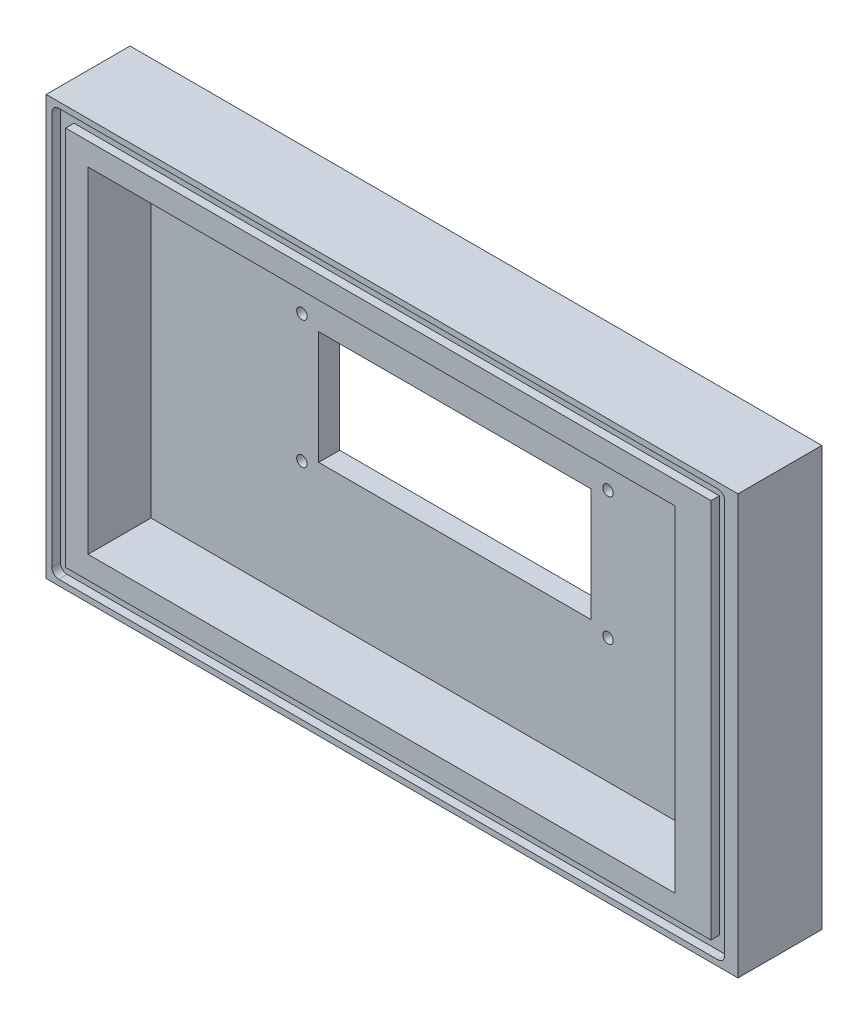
ISO-10303-21;
HEADER;
FILE_DESCRIPTION(('STEP AP214'),'2;1');
FILE_NAME('part.step','',(''),(''),'','','');
FILE_SCHEMA(('AUTOMOTIVE_DESIGN { 1 0 10303 214 1 1 1 1 }'));
ENDSEC;
DATA;
#1=APPLICATION_CONTEXT('core data for automotive mechanical design processes');
#2=APPLICATION_PROTOCOL_DEFINITION('international standard','automotive_design',2000,#1);
#3=PRODUCT_CONTEXT('',#1,'mechanical');
#4=PRODUCT('Part','Part','',(#3));
#5=PRODUCT_RELATED_PRODUCT_CATEGORY('part','',(#4));
#6=PRODUCT_DEFINITION_FORMATION('','',#4);
#7=PRODUCT_DEFINITION_CONTEXT('part definition',#1,'design');
#8=PRODUCT_DEFINITION('design','',#6,#7);
#9=PRODUCT_DEFINITION_SHAPE('','',#8);
#10=(LENGTH_UNIT() NAMED_UNIT(*) SI_UNIT(.MILLI.,.METRE.));
#11=(NAMED_UNIT(*) PLANE_ANGLE_UNIT() SI_UNIT($,.RADIAN.));
#12=(NAMED_UNIT(*) SI_UNIT($,.STERADIAN.) SOLID_ANGLE_UNIT());
#13=UNCERTAINTY_MEASURE_WITH_UNIT(LENGTH_MEASURE(1.E-05),#10,'distance_accuracy_value','');
#14=(GEOMETRIC_REPRESENTATION_CONTEXT(3) GLOBAL_UNCERTAINTY_ASSIGNED_CONTEXT((#13)) GLOBAL_UNIT_ASSIGNED_CONTEXT((#10,
#11,#12)) REPRESENTATION_CONTEXT('',''));
#15=CARTESIAN_POINT('',(0.,0.,0.));
#16=DIRECTION('',(0.,0.,1.));
#17=DIRECTION('',(1.,0.,0.));
#18=AXIS2_PLACEMENT_3D('',#15,#16,#17);
#19=CARTESIAN_POINT('',(0.,0.,20.));
#20=DIRECTION('',(0.,0.,1.));
#21=DIRECTION('',(1.,0.,0.));
#22=AXIS2_PLACEMENT_3D('',#19,#20,#21);
#23=PLANE('',#22);
#24=DIRECTION('',(1.,0.,0.));
#25=VECTOR('',#24,1.);
#26=CARTESIAN_POINT('',(0.,47.5401922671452,20.));
#27=LINE('',#26,#25);
#28=CARTESIAN_POINT('',(-65.2246638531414,47.5401922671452,20.));
#29=VERTEX_POINT('',#28);
#30=CARTESIAN_POINT('',(88.6945547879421,47.5401922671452,20.));
#31=VERTEX_POINT('',#30);
#32=EDGE_CURVE('E59',#29,#31,#27,.T.);
#33=ORIENTED_EDGE('',*,*,#32,.F.);
#34=DIRECTION('',(0.000175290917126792,0.999999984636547,0.));
#35=VECTOR('',#34,1.);
#36=CARTESIAN_POINT('',(-65.2329952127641,0.0114347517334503,20.));
#37=LINE('',#36,#35);
#38=CARTESIAN_POINT('',(-65.2405702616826,-43.202719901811,20.));
#39=VERTEX_POINT('',#38);
#40=EDGE_CURVE('E278',#39,#29,#37,.T.);
#41=ORIENTED_EDGE('',*,*,#40,.F.);
#42=DIRECTION('',(-1.,0.,0.));
#43=VECTOR('',#42,1.);
#44=CARTESIAN_POINT('',(0.,-43.202719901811,20.));
#45=LINE('',#44,#43);
#46=CARTESIAN_POINT('',(88.6945547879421,-43.202719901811,20.));
#47=VERTEX_POINT('',#46);
#48=EDGE_CURVE('E274',#47,#39,#45,.T.);
#49=ORIENTED_EDGE('',*,*,#48,.F.);
#50=DIRECTION('',(0.,-1.,0.));
#51=VECTOR('',#50,1.);
#52=CARTESIAN_POINT('',(88.6945547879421,0.,20.));
#53=LINE('',#52,#51);
#54=EDGE_CURVE('E271',#31,#47,#53,.T.);
#55=ORIENTED_EDGE('',*,*,#54,.F.);
#56=EDGE_LOOP('',(#33,#41,#49,#55));
#57=FACE_BOUND('',#56,.T.);
#58=DIRECTION('',(1.,0.,0.));
#59=VECTOR('',#58,1.);
#60=CARTESIAN_POINT('',(-59.8708560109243,-37.8327199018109,20.));
#61=LINE('',#60,#59);
#62=CARTESIAN_POINT('',(-59.8708560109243,-37.8327199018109,20.));
#63=VERTEX_POINT('',#62);
#64=CARTESIAN_POINT('',(80.1291439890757,-37.8327199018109,20.));
#65=VERTEX_POINT('',#64);
#66=EDGE_CURVE('E399',#63,#65,#61,.T.);
#67=ORIENTED_EDGE('',*,*,#66,.F.);
#68=DIRECTION('',(0.,-1.,0.));
#69=VECTOR('',#68,1.);
#70=CARTESIAN_POINT('',(-59.8708560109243,42.1672800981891,20.));
#71=LINE('',#70,#69);
#72=CARTESIAN_POINT('',(-59.8708560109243,42.1672800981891,20.));
#73=VERTEX_POINT('',#72);
#74=EDGE_CURVE('E405',#73,#63,#71,.T.);
#75=ORIENTED_EDGE('',*,*,#74,.F.);
#76=DIRECTION('',(1.,0.,0.));
#77=VECTOR('',#76,1.);
#78=CARTESIAN_POINT('',(-59.8708560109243,42.1672800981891,20.));
#79=LINE('',#78,#77);
#80=CARTESIAN_POINT('',(80.1291439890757,42.1672800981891,20.));
#81=VERTEX_POINT('',#80);
#82=EDGE_CURVE('E422',#73,#81,#79,.T.);
#83=ORIENTED_EDGE('',*,*,#82,.T.);
#84=DIRECTION('',(0.,-1.,0.));
#85=VECTOR('',#84,1.);
#86=CARTESIAN_POINT('',(80.1291439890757,42.1672800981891,20.));
#87=LINE('',#86,#85);
#88=EDGE_CURVE('E418',#81,#65,#87,.T.);
#89=ORIENTED_EDGE('',*,*,#88,.T.);
#90=EDGE_LOOP('',(#67,#75,#83,#89));
#91=FACE_BOUND('',#90,.T.);
#92=ADVANCED_FACE('F43',(#57,#91),#23,.T.);
#93=CARTESIAN_POINT('',(0.,0.,5.00000000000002));
#94=DIRECTION('',(0.,0.,-1.));
#95=DIRECTION('',(-1.,0.,0.));
#96=AXIS2_PLACEMENT_3D('',#93,#94,#95);
#97=PLANE('',#96);
#98=DIRECTION('',(1.,0.,0.));
#99=VECTOR('',#98,1.);
#100=CARTESIAN_POINT('',(-59.8708560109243,-37.8327199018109,5.00000000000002));
#101=LINE('',#100,#99);
#102=CARTESIAN_POINT('',(-59.8708560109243,-37.8327199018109,5.00000000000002));
#103=VERTEX_POINT('',#102);
#104=CARTESIAN_POINT('',(80.1291439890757,-37.8327199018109,5.00000000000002));
#105=VERTEX_POINT('',#104);
#106=EDGE_CURVE('E400',#103,#105,#101,.T.);
#107=ORIENTED_EDGE('',*,*,#106,.T.);
#108=DIRECTION('',(0.,-1.,0.));
#109=VECTOR('',#108,1.);
#110=CARTESIAN_POINT('',(80.1291439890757,42.1672800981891,5.00000000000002));
#111=LINE('',#110,#109);
#112=CARTESIAN_POINT('',(80.1291439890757,42.1672800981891,5.00000000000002));
#113=VERTEX_POINT('',#112);
#114=EDGE_CURVE('E404',#113,#105,#111,.T.);
#115=ORIENTED_EDGE('',*,*,#114,.F.);
#116=DIRECTION('',(1.,0.,0.));
#117=VECTOR('',#116,1.);
#118=CARTESIAN_POINT('',(-59.8708560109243,42.1672800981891,5.00000000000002));
#119=LINE('',#118,#117);
#120=CARTESIAN_POINT('',(-59.8708560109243,42.1672800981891,5.00000000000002));
#121=VERTEX_POINT('',#120);
#122=EDGE_CURVE('E408',#121,#113,#119,.T.);
#123=ORIENTED_EDGE('',*,*,#122,.F.);
#124=DIRECTION('',(0.,-1.,0.));
#125=VECTOR('',#124,1.);
#126=CARTESIAN_POINT('',(-59.8708560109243,42.1672800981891,5.00000000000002));
#127=LINE('',#126,#125);
#128=EDGE_CURVE('E411',#121,#103,#127,.T.);
#129=ORIENTED_EDGE('',*,*,#128,.T.);
#130=EDGE_LOOP('',(#107,#115,#123,#129));
#131=FACE_BOUND('',#130,.T.);
#132=CARTESIAN_POINT('',(-23.8708560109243,22.3923615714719,5.00000000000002));
#133=DIRECTION('',(0.,0.,1.));
#134=DIRECTION('',(1.,0.,0.));
#135=AXIS2_PLACEMENT_3D('',#132,#133,#134);
#136=CIRCLE('',#135,1.25);
#137=CARTESIAN_POINT('',(-22.6208560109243,22.3923615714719,5.00000000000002));
#138=VERTEX_POINT('',#137);
#139=EDGE_CURVE('E340',#138,#138,#136,.T.);
#140=ORIENTED_EDGE('',*,*,#139,.F.);
#141=EDGE_LOOP('',(#140));
#142=FACE_BOUND('',#141,.T.);
#143=CARTESIAN_POINT('',(-23.8708560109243,-8.05780137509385,5.00000000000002));
#144=DIRECTION('',(0.,0.,1.));
#145=DIRECTION('',(-1.,0.,0.));
#146=AXIS2_PLACEMENT_3D('',#143,#144,#145);
#147=CIRCLE('',#146,1.25);
#148=CARTESIAN_POINT('',(-25.1208560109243,-8.05780137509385,5.00000000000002));
#149=VERTEX_POINT('',#148);
#150=EDGE_CURVE('E345',#149,#149,#147,.T.);
#151=ORIENTED_EDGE('',*,*,#150,.F.);
#152=EDGE_LOOP('',(#151));
#153=FACE_BOUND('',#152,.T.);
#154=CARTESIAN_POINT('',(49.1291439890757,22.3923615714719,5.00000000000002));
#155=DIRECTION('',(0.,0.,1.));
#156=DIRECTION('',(-1.,0.,0.));
#157=AXIS2_PLACEMENT_3D('',#154,#155,#156);
#158=CIRCLE('',#157,1.25);
#159=CARTESIAN_POINT('',(47.8791439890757,22.3923615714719,5.00000000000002));
#160=VERTEX_POINT('',#159);
#161=EDGE_CURVE('E349',#160,#160,#158,.T.);
#162=ORIENTED_EDGE('',*,*,#161,.F.);
#163=EDGE_LOOP('',(#162));
#164=FACE_BOUND('',#163,.T.);
#165=CARTESIAN_POINT('',(49.1291439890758,-8.05780137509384,5.00000000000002));
#166=DIRECTION('',(0.,0.,1.));
#167=DIRECTION('',(1.,0.,0.));
#168=AXIS2_PLACEMENT_3D('',#165,#166,#167);
#169=CIRCLE('',#168,1.25);
#170=CARTESIAN_POINT('',(50.3791439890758,-8.05780137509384,5.00000000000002));
#171=VERTEX_POINT('',#170);
#172=EDGE_CURVE('E310',#171,#171,#169,.T.);
#173=ORIENTED_EDGE('',*,*,#172,.F.);
#174=EDGE_LOOP('',(#173));
#175=FACE_BOUND('',#174,.T.);
#176=DIRECTION('',(0.,-1.,0.));
#177=VECTOR('',#176,1.);
#178=CARTESIAN_POINT('',(-19.8708560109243,20.667280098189,5.00000000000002));
#179=LINE('',#178,#177);
#180=CARTESIAN_POINT('',(-19.8708560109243,20.667280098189,5.00000000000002));
#181=VERTEX_POINT('',#180);
#182=CARTESIAN_POINT('',(-19.8708560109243,-6.33271990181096,5.00000000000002));
#183=VERTEX_POINT('',#182);
#184=EDGE_CURVE('E344',#181,#183,#179,.T.);
#185=ORIENTED_EDGE('',*,*,#184,.F.);
#186=DIRECTION('',(-1.,0.,0.));
#187=VECTOR('',#186,1.);
#188=CARTESIAN_POINT('',(-19.8708560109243,20.667280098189,5.00000000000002));
#189=LINE('',#188,#187);
#190=CARTESIAN_POINT('',(45.1291439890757,20.667280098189,5.00000000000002));
#191=VERTEX_POINT('',#190);
#192=EDGE_CURVE('E366',#191,#181,#189,.T.);
#193=ORIENTED_EDGE('',*,*,#192,.F.);
#194=DIRECTION('',(0.,1.,0.));
#195=VECTOR('',#194,1.);
#196=CARTESIAN_POINT('',(45.1291439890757,20.667280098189,5.00000000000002));
#197=LINE('',#196,#195);
#198=CARTESIAN_POINT('',(45.1291439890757,-6.33271990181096,5.00000000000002));
#199=VERTEX_POINT('',#198);
#200=EDGE_CURVE('E363',#199,#191,#197,.T.);
#201=ORIENTED_EDGE('',*,*,#200,.F.);
#202=DIRECTION('',(1.,0.,0.));
#203=VECTOR('',#202,1.);
#204=CARTESIAN_POINT('',(-19.8708560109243,-6.33271990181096,5.00000000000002));
#205=LINE('',#204,#203);
#206=EDGE_CURVE('E359',#183,#199,#205,.T.);
#207=ORIENTED_EDGE('',*,*,#206,.F.);
#208=EDGE_LOOP('',(#185,#193,#201,#207));
#209=FACE_BOUND('',#208,.T.);
#210=ADVANCED_FACE('F507',(#131,#142,#153,#164,#175,#209),#97,.F.);
#211=CARTESIAN_POINT('',(-69.8708560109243,52.167280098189,20.));
#212=DIRECTION('',(1.,0.,0.));
#213=DIRECTION('',(0.,0.,-1.));
#214=AXIS2_PLACEMENT_3D('',#211,#212,#213);
#215=PLANE('',#214);
#216=DIRECTION('',(0.,-1.,0.));
#217=VECTOR('',#216,1.);
#218=CARTESIAN_POINT('',(-69.8708560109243,52.167280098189,0.));
#219=LINE('',#218,#217);
#220=CARTESIAN_POINT('',(-69.8708560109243,52.167280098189,0.));
#221=VERTEX_POINT('',#220);
#222=CARTESIAN_POINT('',(-69.8708560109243,-47.832719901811,0.));
#223=VERTEX_POINT('',#222);
#224=EDGE_CURVE('E432',#221,#223,#219,.T.);
#225=ORIENTED_EDGE('',*,*,#224,.T.);
#226=DIRECTION('',(0.,0.,-1.));
#227=VECTOR('',#226,1.);
#228=CARTESIAN_POINT('',(-69.8708560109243,-47.832719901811,20.));
#229=LINE('',#228,#227);
#230=CARTESIAN_POINT('',(-69.8708560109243,-47.832719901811,20.));
#231=VERTEX_POINT('',#230);
#232=EDGE_CURVE('E479',#231,#223,#229,.T.);
#233=ORIENTED_EDGE('',*,*,#232,.F.);
#234=DIRECTION('',(0.,-1.,0.));
#235=VECTOR('',#234,1.);
#236=CARTESIAN_POINT('',(-69.8708560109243,52.167280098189,20.));
#237=LINE('',#236,#235);
#238=CARTESIAN_POINT('',(-69.8708560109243,52.167280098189,20.));
#239=VERTEX_POINT('',#238);
#240=EDGE_CURVE('E442',#239,#231,#237,.T.);
#241=ORIENTED_EDGE('',*,*,#240,.F.);
#242=DIRECTION('',(0.,0.,-1.));
#243=VECTOR('',#242,1.);
#244=CARTESIAN_POINT('',(-69.8708560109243,52.167280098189,20.));
#245=LINE('',#244,#243);
#246=EDGE_CURVE('E456',#239,#221,#245,.T.);
#247=ORIENTED_EDGE('',*,*,#246,.T.);
#248=EDGE_LOOP('',(#225,#233,#241,#247));
#249=FACE_BOUND('',#248,.T.);
#250=ADVANCED_FACE('F45',(#249),#215,.F.);
#251=CARTESIAN_POINT('',(-69.8708560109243,-47.832719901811,20.));
#252=DIRECTION('',(0.,1.,0.));
#253=DIRECTION('',(-1.,0.,0.));
#254=AXIS2_PLACEMENT_3D('',#251,#252,#253);
#255=PLANE('',#254);
#256=DIRECTION('',(1.,0.,0.));
#257=VECTOR('',#256,1.);
#258=CARTESIAN_POINT('',(-69.8708560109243,-47.832719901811,0.));
#259=LINE('',#258,#257);
#260=CARTESIAN_POINT('',(95.1291439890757,-47.8327199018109,0.));
#261=VERTEX_POINT('',#260);
#262=EDGE_CURVE('E460',#223,#261,#259,.T.);
#263=ORIENTED_EDGE('',*,*,#262,.T.);
#264=DIRECTION('',(0.,0.,-1.));
#265=VECTOR('',#264,1.);
#266=CARTESIAN_POINT('',(95.1291439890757,-47.8327199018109,20.));
#267=LINE('',#266,#265);
#268=CARTESIAN_POINT('',(95.1291439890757,-47.8327199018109,20.));
#269=VERTEX_POINT('',#268);
#270=EDGE_CURVE('E475',#269,#261,#267,.T.);
#271=ORIENTED_EDGE('',*,*,#270,.F.);
#272=DIRECTION('',(1.,0.,0.));
#273=VECTOR('',#272,1.);
#274=CARTESIAN_POINT('',(-69.8708560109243,-47.832719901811,20.));
#275=LINE('',#274,#273);
#276=EDGE_CURVE('E446',#231,#269,#275,.T.);
#277=ORIENTED_EDGE('',*,*,#276,.F.);
#278=ORIENTED_EDGE('',*,*,#232,.T.);
#279=EDGE_LOOP('',(#263,#271,#277,#278));
#280=FACE_BOUND('',#279,.T.);
#281=ADVANCED_FACE('F557',(#280),#255,.F.);
#282=CARTESIAN_POINT('',(95.1291439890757,52.1672800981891,20.));
#283=DIRECTION('',(-1.,0.,0.));
#284=DIRECTION('',(0.,0.,1.));
#285=AXIS2_PLACEMENT_3D('',#282,#283,#284);
#286=PLANE('',#285);
#287=DIRECTION('',(0.,1.,0.));
#288=VECTOR('',#287,1.);
#289=CARTESIAN_POINT('',(95.1291439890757,52.1672800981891,0.));
#290=LINE('',#289,#288);
#291=CARTESIAN_POINT('',(95.1291439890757,52.1672800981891,0.));
#292=VERTEX_POINT('',#291);
#293=EDGE_CURVE('E463',#261,#292,#290,.T.);
#294=ORIENTED_EDGE('',*,*,#293,.T.);
#295=DIRECTION('',(0.,0.,-1.));
#296=VECTOR('',#295,1.);
#297=CARTESIAN_POINT('',(95.1291439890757,52.1672800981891,20.));
#298=LINE('',#297,#296);
#299=CARTESIAN_POINT('',(95.1291439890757,52.1672800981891,20.));
#300=VERTEX_POINT('',#299);
#301=EDGE_CURVE('E471',#300,#292,#298,.T.);
#302=ORIENTED_EDGE('',*,*,#301,.F.);
#303=DIRECTION('',(0.,1.,0.));
#304=VECTOR('',#303,1.);
#305=CARTESIAN_POINT('',(95.1291439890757,52.1672800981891,20.));
#306=LINE('',#305,#304);
#307=EDGE_CURVE('E450',#269,#300,#306,.T.);
#308=ORIENTED_EDGE('',*,*,#307,.F.);
#309=ORIENTED_EDGE('',*,*,#270,.T.);
#310=EDGE_LOOP('',(#294,#302,#308,#309));
#311=FACE_BOUND('',#310,.T.);
#312=ADVANCED_FACE('F545',(#311),#286,.F.);
#313=CARTESIAN_POINT('',(-69.8708560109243,52.167280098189,20.));
#314=DIRECTION('',(0.,-1.,0.));
#315=DIRECTION('',(1.,0.,0.));
#316=AXIS2_PLACEMENT_3D('',#313,#314,#315);
#317=PLANE('',#316);
#318=DIRECTION('',(-1.,0.,0.));
#319=VECTOR('',#318,1.);
#320=CARTESIAN_POINT('',(-69.8708560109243,52.167280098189,0.));
#321=LINE('',#320,#319);
#322=EDGE_CURVE('E447',#292,#221,#321,.T.);
#323=ORIENTED_EDGE('',*,*,#322,.T.);
#324=ORIENTED_EDGE('',*,*,#246,.F.);
#325=DIRECTION('',(-1.,0.,0.));
#326=VECTOR('',#325,1.);
#327=CARTESIAN_POINT('',(-69.8708560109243,52.167280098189,20.));
#328=LINE('',#327,#326);
#329=EDGE_CURVE('E453',#300,#239,#328,.T.);
#330=ORIENTED_EDGE('',*,*,#329,.F.);
#331=ORIENTED_EDGE('',*,*,#301,.T.);
#332=EDGE_LOOP('',(#323,#324,#330,#331));
#333=FACE_BOUND('',#332,.T.);
#334=ADVANCED_FACE('F537',(#333),#317,.F.);
#335=CARTESIAN_POINT('',(90.3245547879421,49.1672800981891,20.));
#336=DIRECTION('',(0.,0.,1.));
#337=DIRECTION('',(1.,0.,0.));
#338=AXIS2_PLACEMENT_3D('',#335,#336,#337);
#339=CIRCLE('',#338,1.63000000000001);
#340=CARTESIAN_POINT('',(91.9545547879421,49.1672800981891,20.));
#341=VERTEX_POINT('',#340);
#342=CARTESIAN_POINT('',(90.2271628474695,50.7943679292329,20.));
#343=VERTEX_POINT('',#342);
#344=EDGE_CURVE('E67',#341,#343,#339,.T.);
#345=ORIENTED_EDGE('',*,*,#344,.F.);
#346=DIRECTION('',(0.,-1.,0.));
#347=VECTOR('',#346,1.);
#348=CARTESIAN_POINT('',(91.9545547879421,0.,20.));
#349=LINE('',#348,#347);
#350=CARTESIAN_POINT('',(91.9545547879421,-44.832719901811,20.));
#351=VERTEX_POINT('',#350);
#352=EDGE_CURVE('E231',#341,#351,#349,.T.);
#353=ORIENTED_EDGE('',*,*,#352,.T.);
#354=CARTESIAN_POINT('',(90.3245547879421,-44.832719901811,20.));
#355=DIRECTION('',(0.,0.,1.));
#356=DIRECTION('',(1.,0.,0.));
#357=AXIS2_PLACEMENT_3D('',#354,#355,#356);
#358=CIRCLE('',#357,1.63000000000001);
#359=CARTESIAN_POINT('',(90.3245547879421,-46.462719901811,20.));
#360=VERTEX_POINT('',#359);
#361=EDGE_CURVE('E235',#360,#351,#358,.T.);
#362=ORIENTED_EDGE('',*,*,#361,.F.);
#363=DIRECTION('',(-1.,0.,0.));
#364=VECTOR('',#363,1.);
#365=CARTESIAN_POINT('',(0.,-46.462719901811,20.));
#366=LINE('',#365,#364);
#367=CARTESIAN_POINT('',(-66.8708560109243,-46.462719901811,20.));
#368=VERTEX_POINT('',#367);
#369=EDGE_CURVE('E300',#360,#368,#366,.T.);
#370=ORIENTED_EDGE('',*,*,#369,.T.);
#371=CARTESIAN_POINT('',(-66.8708560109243,-44.832719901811,20.));
#372=DIRECTION('',(0.,0.,1.));
#373=DIRECTION('',(1.,0.,0.));
#374=AXIS2_PLACEMENT_3D('',#371,#372,#373);
#375=CIRCLE('',#374,1.62999999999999);
#376=CARTESIAN_POINT('',(-68.5008559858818,-44.8324341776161,20.));
#377=VERTEX_POINT('',#376);
#378=EDGE_CURVE('E296',#377,#368,#375,.T.);
#379=ORIENTED_EDGE('',*,*,#378,.F.);
#380=DIRECTION('',(0.000175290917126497,0.999999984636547,0.));
#381=VECTOR('',#380,1.);
#382=CARTESIAN_POINT('',(-68.4929951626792,0.0120062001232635,20.));
#383=LINE('',#382,#381);
#384=CARTESIAN_POINT('',(-68.4843786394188,49.167565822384,20.));
#385=VERTEX_POINT('',#384);
#386=EDGE_CURVE('E292',#377,#385,#383,.T.);
#387=ORIENTED_EDGE('',*,*,#386,.T.);
#388=CARTESIAN_POINT('',(-66.8543786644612,49.1672800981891,20.));
#389=DIRECTION('',(0.,0.,1.));
#390=DIRECTION('',(1.,0.,0.));
#391=AXIS2_PLACEMENT_3D('',#388,#389,#390);
#392=CIRCLE('',#391,1.62999999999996);
#393=CARTESIAN_POINT('',(-66.7569867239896,50.7943679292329,20.));
#394=VERTEX_POINT('',#393);
#395=EDGE_CURVE('E288',#394,#385,#392,.T.);
#396=ORIENTED_EDGE('',*,*,#395,.F.);
#397=DIRECTION('',(1.,0.,0.));
#398=VECTOR('',#397,1.);
#399=CARTESIAN_POINT('',(0.,50.7943679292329,20.));
#400=LINE('',#399,#398);
#401=EDGE_CURVE('E284',#394,#343,#400,.T.);
#402=ORIENTED_EDGE('',*,*,#401,.T.);
#403=EDGE_LOOP('',(#345,#353,#362,#370,#379,#387,#396,#402));
#404=FACE_BOUND('',#403,.T.);
#405=ORIENTED_EDGE('',*,*,#240,.T.);
#406=ORIENTED_EDGE('',*,*,#276,.T.);
#407=ORIENTED_EDGE('',*,*,#307,.T.);
#408=ORIENTED_EDGE('',*,*,#329,.T.);
#409=EDGE_LOOP('',(#405,#406,#407,#408));
#410=FACE_BOUND('',#409,.T.);
#411=ADVANCED_FACE('F527',(#404,#410),#23,.T.);
#412=CARTESIAN_POINT('',(0.,0.,0.));
#413=DIRECTION('',(0.,0.,1.));
#414=DIRECTION('',(1.,0.,0.));
#415=AXIS2_PLACEMENT_3D('',#412,#413,#414);
#416=PLANE('',#415);
#417=CARTESIAN_POINT('',(49.1291439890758,-8.05780137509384,0.));
#418=DIRECTION('',(0.,0.,1.));
#419=DIRECTION('',(1.,0.,0.));
#420=AXIS2_PLACEMENT_3D('',#417,#418,#419);
#421=CIRCLE('',#420,1.25);
#422=CARTESIAN_POINT('',(50.3791439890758,-8.05780137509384,0.));
#423=VERTEX_POINT('',#422);
#424=EDGE_CURVE('E395',#423,#423,#421,.T.);
#425=ORIENTED_EDGE('',*,*,#424,.T.);
#426=EDGE_LOOP('',(#425));
#427=FACE_BOUND('',#426,.T.);
#428=CARTESIAN_POINT('',(49.1291439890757,22.3923615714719,0.));
#429=DIRECTION('',(0.,0.,1.));
#430=DIRECTION('',(1.,0.,0.));
#431=AXIS2_PLACEMENT_3D('',#428,#429,#430);
#432=CIRCLE('',#431,1.25);
#433=CARTESIAN_POINT('',(50.3791439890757,22.3923615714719,0.));
#434=VERTEX_POINT('',#433);
#435=EDGE_CURVE('E391',#434,#434,#432,.T.);
#436=ORIENTED_EDGE('',*,*,#435,.T.);
#437=EDGE_LOOP('',(#436));
#438=FACE_BOUND('',#437,.T.);
#439=CARTESIAN_POINT('',(-23.8708560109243,-8.05780137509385,0.));
#440=DIRECTION('',(0.,0.,1.));
#441=DIRECTION('',(1.,0.,0.));
#442=AXIS2_PLACEMENT_3D('',#439,#440,#441);
#443=CIRCLE('',#442,1.25);
#444=CARTESIAN_POINT('',(-22.6208560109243,-8.05780137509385,0.));
#445=VERTEX_POINT('',#444);
#446=EDGE_CURVE('E387',#445,#445,#443,.T.);
#447=ORIENTED_EDGE('',*,*,#446,.T.);
#448=EDGE_LOOP('',(#447));
#449=FACE_BOUND('',#448,.T.);
#450=CARTESIAN_POINT('',(-23.8708560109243,22.3923615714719,0.));
#451=DIRECTION('',(0.,0.,1.));
#452=DIRECTION('',(1.,0.,0.));
#453=AXIS2_PLACEMENT_3D('',#450,#451,#452);
#454=CIRCLE('',#453,1.25);
#455=CARTESIAN_POINT('',(-22.6208560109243,22.3923615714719,0.));
#456=VERTEX_POINT('',#455);
#457=EDGE_CURVE('E374',#456,#456,#454,.T.);
#458=ORIENTED_EDGE('',*,*,#457,.T.);
#459=EDGE_LOOP('',(#458));
#460=FACE_BOUND('',#459,.T.);
#461=DIRECTION('',(-1.,0.,0.));
#462=VECTOR('',#461,1.);
#463=CARTESIAN_POINT('',(0.,20.667280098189,0.));
#464=LINE('',#463,#462);
#465=CARTESIAN_POINT('',(45.1291439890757,20.667280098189,0.));
#466=VERTEX_POINT('',#465);
#467=CARTESIAN_POINT('',(-19.8708560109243,20.667280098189,0.));
#468=VERTEX_POINT('',#467);
#469=EDGE_CURVE('E52',#466,#468,#464,.T.);
#470=ORIENTED_EDGE('',*,*,#469,.T.);
#471=DIRECTION('',(0.,-1.,0.));
#472=VECTOR('',#471,1.);
#473=CARTESIAN_POINT('',(-19.8708560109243,0.,0.));
#474=LINE('',#473,#472);
#475=CARTESIAN_POINT('',(-19.8708560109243,-6.33271990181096,0.));
#476=VERTEX_POINT('',#475);
#477=EDGE_CURVE('E11',#468,#476,#474,.T.);
#478=ORIENTED_EDGE('',*,*,#477,.T.);
#479=DIRECTION('',(1.,0.,0.));
#480=VECTOR('',#479,1.);
#481=CARTESIAN_POINT('',(0.,-6.33271990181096,0.));
#482=LINE('',#481,#480);
#483=CARTESIAN_POINT('',(45.1291439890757,-6.33271990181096,0.));
#484=VERTEX_POINT('',#483);
#485=EDGE_CURVE('E483',#476,#484,#482,.T.);
#486=ORIENTED_EDGE('',*,*,#485,.T.);
#487=DIRECTION('',(0.,1.,0.));
#488=VECTOR('',#487,1.);
#489=CARTESIAN_POINT('',(45.1291439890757,0.,0.));
#490=LINE('',#489,#488);
#491=EDGE_CURVE('E487',#484,#466,#490,.T.);
#492=ORIENTED_EDGE('',*,*,#491,.T.);
#493=EDGE_LOOP('',(#470,#478,#486,#492));
#494=FACE_BOUND('',#493,.T.);
#495=ORIENTED_EDGE('',*,*,#224,.F.);
#496=ORIENTED_EDGE('',*,*,#322,.F.);
#497=ORIENTED_EDGE('',*,*,#293,.F.);
#498=ORIENTED_EDGE('',*,*,#262,.F.);
#499=EDGE_LOOP('',(#495,#496,#497,#498));
#500=FACE_BOUND('',#499,.T.);
#501=ADVANCED_FACE('F493',(#427,#438,#449,#460,#494,#500),#416,.F.);
#502=CARTESIAN_POINT('',(-59.8708560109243,-37.8327199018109,5.00000000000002));
#503=DIRECTION('',(0.,-1.,0.));
#504=DIRECTION('',(0.,0.,-1.));
#505=AXIS2_PLACEMENT_3D('',#502,#503,#504);
#506=PLANE('',#505);
#507=ORIENTED_EDGE('',*,*,#66,.T.);
#508=DIRECTION('',(0.,0.,1.));
#509=VECTOR('',#508,1.);
#510=CARTESIAN_POINT('',(80.1291439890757,-37.8327199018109,5.00000000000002));
#511=LINE('',#510,#509);
#512=EDGE_CURVE('E415',#105,#65,#511,.T.);
#513=ORIENTED_EDGE('',*,*,#512,.F.);
#514=ORIENTED_EDGE('',*,*,#106,.F.);
#515=DIRECTION('',(0.,0.,1.));
#516=VECTOR('',#515,1.);
#517=CARTESIAN_POINT('',(-59.8708560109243,-37.8327199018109,5.00000000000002));
#518=LINE('',#517,#516);
#519=EDGE_CURVE('E429',#103,#63,#518,.T.);
#520=ORIENTED_EDGE('',*,*,#519,.T.);
#521=EDGE_LOOP('',(#507,#513,#514,#520));
#522=FACE_BOUND('',#521,.T.);
#523=ADVANCED_FACE('F543',(#522),#506,.F.);
#524=CARTESIAN_POINT('',(-59.8708560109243,42.1672800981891,5.00000000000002));
#525=DIRECTION('',(-1.,0.,0.));
#526=DIRECTION('',(0.,-1.,0.));
#527=AXIS2_PLACEMENT_3D('',#524,#525,#526);
#528=PLANE('',#527);
#529=ORIENTED_EDGE('',*,*,#74,.T.);
#530=ORIENTED_EDGE('',*,*,#519,.F.);
#531=ORIENTED_EDGE('',*,*,#128,.F.);
#532=DIRECTION('',(0.,0.,1.));
#533=VECTOR('',#532,1.);
#534=CARTESIAN_POINT('',(-59.8708560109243,42.1672800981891,5.00000000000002));
#535=LINE('',#534,#533);
#536=EDGE_CURVE('E433',#121,#73,#535,.T.);
#537=ORIENTED_EDGE('',*,*,#536,.T.);
#538=EDGE_LOOP('',(#529,#530,#531,#537));
#539=FACE_BOUND('',#538,.T.);
#540=ADVANCED_FACE('F895',(#539),#528,.F.);
#541=CARTESIAN_POINT('',(-59.8708560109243,42.1672800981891,5.00000000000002));
#542=DIRECTION('',(0.,-1.,0.));
#543=DIRECTION('',(0.,0.,-1.));
#544=AXIS2_PLACEMENT_3D('',#541,#542,#543);
#545=PLANE('',#544);
#546=ORIENTED_EDGE('',*,*,#82,.F.);
#547=ORIENTED_EDGE('',*,*,#536,.F.);
#548=ORIENTED_EDGE('',*,*,#122,.T.);
#549=DIRECTION('',(0.,0.,1.));
#550=VECTOR('',#549,1.);
#551=CARTESIAN_POINT('',(80.1291439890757,42.1672800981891,5.00000000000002));
#552=LINE('',#551,#550);
#553=EDGE_CURVE('E436',#113,#81,#552,.T.);
#554=ORIENTED_EDGE('',*,*,#553,.T.);
#555=EDGE_LOOP('',(#546,#547,#548,#554));
#556=FACE_BOUND('',#555,.T.);
#557=ADVANCED_FACE('F904',(#556),#545,.T.);
#558=CARTESIAN_POINT('',(80.1291439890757,42.1672800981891,5.00000000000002));
#559=DIRECTION('',(-1.,0.,0.));
#560=DIRECTION('',(0.,0.,1.));
#561=AXIS2_PLACEMENT_3D('',#558,#559,#560);
#562=PLANE('',#561);
#563=ORIENTED_EDGE('',*,*,#88,.F.);
#564=ORIENTED_EDGE('',*,*,#553,.F.);
#565=ORIENTED_EDGE('',*,*,#114,.T.);
#566=ORIENTED_EDGE('',*,*,#512,.T.);
#567=EDGE_LOOP('',(#563,#564,#565,#566));
#568=FACE_BOUND('',#567,.T.);
#569=ADVANCED_FACE('F585',(#568),#562,.T.);
#570=CARTESIAN_POINT('',(-23.8708560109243,22.3923615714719,-9.99999999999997));
#571=DIRECTION('',(0.,0.,1.));
#572=DIRECTION('',(1.,0.,0.));
#573=AXIS2_PLACEMENT_3D('',#570,#571,#572);
#574=CYLINDRICAL_SURFACE('',#573,1.25);
#575=ORIENTED_EDGE('',*,*,#139,.T.);
#576=EDGE_LOOP('',(#575));
#577=FACE_BOUND('',#576,.T.);
#578=ORIENTED_EDGE('',*,*,#457,.F.);
#579=EDGE_LOOP('',(#578));
#580=FACE_BOUND('',#579,.T.);
#581=ADVANCED_FACE('F600',(#577,#580),#574,.F.);
#582=CARTESIAN_POINT('',(-23.8708560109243,-8.05780137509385,-9.99999999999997));
#583=DIRECTION('',(0.,0.,1.));
#584=DIRECTION('',(1.,0.,0.));
#585=AXIS2_PLACEMENT_3D('',#582,#583,#584);
#586=CYLINDRICAL_SURFACE('',#585,1.25);
#587=ORIENTED_EDGE('',*,*,#150,.T.);
#588=EDGE_LOOP('',(#587));
#589=FACE_BOUND('',#588,.T.);
#590=ORIENTED_EDGE('',*,*,#446,.F.);
#591=EDGE_LOOP('',(#590));
#592=FACE_BOUND('',#591,.T.);
#593=ADVANCED_FACE('F605',(#589,#592),#586,.F.);
#594=CARTESIAN_POINT('',(49.1291439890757,22.3923615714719,-9.99999999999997));
#595=DIRECTION('',(0.,0.,1.));
#596=DIRECTION('',(1.,0.,0.));
#597=AXIS2_PLACEMENT_3D('',#594,#595,#596);
#598=CYLINDRICAL_SURFACE('',#597,1.25);
#599=ORIENTED_EDGE('',*,*,#161,.T.);
#600=EDGE_LOOP('',(#599));
#601=FACE_BOUND('',#600,.T.);
#602=ORIENTED_EDGE('',*,*,#435,.F.);
#603=EDGE_LOOP('',(#602));
#604=FACE_BOUND('',#603,.T.);
#605=ADVANCED_FACE('F615',(#601,#604),#598,.F.);
#606=CARTESIAN_POINT('',(49.1291439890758,-8.05780137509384,-9.99999999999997));
#607=DIRECTION('',(0.,0.,1.));
#608=DIRECTION('',(1.,0.,0.));
#609=AXIS2_PLACEMENT_3D('',#606,#607,#608);
#610=CYLINDRICAL_SURFACE('',#609,1.25);
#611=ORIENTED_EDGE('',*,*,#172,.T.);
#612=EDGE_LOOP('',(#611));
#613=FACE_BOUND('',#612,.T.);
#614=ORIENTED_EDGE('',*,*,#424,.F.);
#615=EDGE_LOOP('',(#614));
#616=FACE_BOUND('',#615,.T.);
#617=ADVANCED_FACE('F626',(#613,#616),#610,.F.);
#618=CARTESIAN_POINT('',(-19.8708560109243,20.667280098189,-9.99999999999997));
#619=DIRECTION('',(-1.,0.,0.));
#620=DIRECTION('',(0.,-1.,0.));
#621=AXIS2_PLACEMENT_3D('',#618,#619,#620);
#622=PLANE('',#621);
#623=DIRECTION('',(0.,0.,1.));
#624=VECTOR('',#623,1.);
#625=CARTESIAN_POINT('',(-19.8708560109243,20.667280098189,-9.99999999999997));
#626=LINE('',#625,#624);
#627=EDGE_CURVE('E371',#468,#181,#626,.T.);
#628=ORIENTED_EDGE('',*,*,#627,.T.);
#629=ORIENTED_EDGE('',*,*,#184,.T.);
#630=DIRECTION('',(0.,0.,1.));
#631=VECTOR('',#630,1.);
#632=CARTESIAN_POINT('',(-19.8708560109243,-6.33271990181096,-9.99999999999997));
#633=LINE('',#632,#631);
#634=EDGE_CURVE('E370',#476,#183,#633,.T.);
#635=ORIENTED_EDGE('',*,*,#634,.F.);
#636=ORIENTED_EDGE('',*,*,#477,.F.);
#637=EDGE_LOOP('',(#628,#629,#635,#636));
#638=FACE_BOUND('',#637,.T.);
#639=ADVANCED_FACE('F510',(#638),#622,.F.);
#640=CARTESIAN_POINT('',(-19.8708560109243,20.667280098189,-9.99999999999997));
#641=DIRECTION('',(0.,1.,0.));
#642=DIRECTION('',(0.,0.,1.));
#643=AXIS2_PLACEMENT_3D('',#640,#641,#642);
#644=PLANE('',#643);
#645=DIRECTION('',(0.,0.,1.));
#646=VECTOR('',#645,1.);
#647=CARTESIAN_POINT('',(45.1291439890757,20.667280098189,-9.99999999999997));
#648=LINE('',#647,#646);
#649=EDGE_CURVE('E375',#466,#191,#648,.T.);
#650=ORIENTED_EDGE('',*,*,#649,.T.);
#651=ORIENTED_EDGE('',*,*,#192,.T.);
#652=ORIENTED_EDGE('',*,*,#627,.F.);
#653=ORIENTED_EDGE('',*,*,#469,.F.);
#654=EDGE_LOOP('',(#650,#651,#652,#653));
#655=FACE_BOUND('',#654,.T.);
#656=ADVANCED_FACE('F499',(#655),#644,.F.);
#657=CARTESIAN_POINT('',(45.1291439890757,20.667280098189,-9.99999999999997));
#658=DIRECTION('',(1.,0.,0.));
#659=DIRECTION('',(0.,0.,-1.));
#660=AXIS2_PLACEMENT_3D('',#657,#658,#659);
#661=PLANE('',#660);
#662=DIRECTION('',(0.,0.,1.));
#663=VECTOR('',#662,1.);
#664=CARTESIAN_POINT('',(45.1291439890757,-6.33271990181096,-9.99999999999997));
#665=LINE('',#664,#663);
#666=EDGE_CURVE('E379',#484,#199,#665,.T.);
#667=ORIENTED_EDGE('',*,*,#666,.T.);
#668=ORIENTED_EDGE('',*,*,#200,.T.);
#669=ORIENTED_EDGE('',*,*,#649,.F.);
#670=ORIENTED_EDGE('',*,*,#491,.F.);
#671=EDGE_LOOP('',(#667,#668,#669,#670));
#672=FACE_BOUND('',#671,.T.);
#673=ADVANCED_FACE('F502',(#672),#661,.F.);
#674=CARTESIAN_POINT('',(-19.8708560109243,-6.33271990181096,-9.99999999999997));
#675=DIRECTION('',(0.,-1.,0.));
#676=DIRECTION('',(0.,0.,-1.));
#677=AXIS2_PLACEMENT_3D('',#674,#675,#676);
#678=PLANE('',#677);
#679=ORIENTED_EDGE('',*,*,#634,.T.);
#680=ORIENTED_EDGE('',*,*,#206,.T.);
#681=ORIENTED_EDGE('',*,*,#666,.F.);
#682=ORIENTED_EDGE('',*,*,#485,.F.);
#683=EDGE_LOOP('',(#679,#680,#681,#682));
#684=FACE_BOUND('',#683,.T.);
#685=ADVANCED_FACE('F512',(#684),#678,.F.);
#686=CARTESIAN_POINT('',(90.3245547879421,49.1672800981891,18.));
#687=DIRECTION('',(0.,0.,1.));
#688=DIRECTION('',(1.,0.,0.));
#689=AXIS2_PLACEMENT_3D('',#686,#687,#688);
#690=CYLINDRICAL_SURFACE('',#689,1.63000000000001);
#691=ORIENTED_EDGE('',*,*,#344,.T.);
#692=DIRECTION('',(0.,0.,1.));
#693=VECTOR('',#692,1.);
#694=CARTESIAN_POINT('',(90.2271628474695,50.7943679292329,18.));
#695=LINE('',#694,#693);
#696=CARTESIAN_POINT('',(90.2271628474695,50.7943679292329,18.));
#697=VERTEX_POINT('',#696);
#698=EDGE_CURVE('E329',#697,#343,#695,.T.);
#699=ORIENTED_EDGE('',*,*,#698,.F.);
#700=CARTESIAN_POINT('',(90.3245547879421,49.1672800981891,18.));
#701=DIRECTION('',(0.,0.,1.));
#702=DIRECTION('',(1.,0.,0.));
#703=AXIS2_PLACEMENT_3D('',#700,#701,#702);
#704=CIRCLE('',#703,1.63000000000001);
#705=CARTESIAN_POINT('',(91.9545547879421,49.1672800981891,18.));
#706=VERTEX_POINT('',#705);
#707=EDGE_CURVE('E242',#706,#697,#704,.T.);
#708=ORIENTED_EDGE('',*,*,#707,.F.);
#709=DIRECTION('',(0.,0.,1.));
#710=VECTOR('',#709,1.);
#711=CARTESIAN_POINT('',(91.9545547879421,49.1672800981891,18.));
#712=LINE('',#711,#710);
#713=EDGE_CURVE('E307',#706,#341,#712,.T.);
#714=ORIENTED_EDGE('',*,*,#713,.T.);
#715=EDGE_LOOP('',(#691,#699,#708,#714));
#716=FACE_BOUND('',#715,.T.);
#717=ADVANCED_FACE('F514',(#716),#690,.F.);
#718=CARTESIAN_POINT('',(91.9545547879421,0.,18.));
#719=DIRECTION('',(-1.,0.,0.));
#720=DIRECTION('',(0.,-1.,0.));
#721=AXIS2_PLACEMENT_3D('',#718,#719,#720);
#722=PLANE('',#721);
#723=ORIENTED_EDGE('',*,*,#352,.F.);
#724=ORIENTED_EDGE('',*,*,#713,.F.);
#725=DIRECTION('',(0.,-1.,0.));
#726=VECTOR('',#725,1.);
#727=CARTESIAN_POINT('',(91.9545547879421,0.,18.));
#728=LINE('',#727,#726);
#729=CARTESIAN_POINT('',(91.9545547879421,-44.832719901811,18.));
#730=VERTEX_POINT('',#729);
#731=EDGE_CURVE('E215',#706,#730,#728,.T.);
#732=ORIENTED_EDGE('',*,*,#731,.T.);
#733=DIRECTION('',(0.,0.,1.));
#734=VECTOR('',#733,1.);
#735=CARTESIAN_POINT('',(91.9545547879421,-44.832719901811,18.));
#736=LINE('',#735,#734);
#737=EDGE_CURVE('E311',#730,#351,#736,.T.);
#738=ORIENTED_EDGE('',*,*,#737,.T.);
#739=EDGE_LOOP('',(#723,#724,#732,#738));
#740=FACE_BOUND('',#739,.T.);
#741=ADVANCED_FACE('F520',(#740),#722,.T.);
#742=CARTESIAN_POINT('',(90.3245547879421,-44.832719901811,18.));
#743=DIRECTION('',(0.,0.,1.));
#744=DIRECTION('',(1.,0.,0.));
#745=AXIS2_PLACEMENT_3D('',#742,#743,#744);
#746=CYLINDRICAL_SURFACE('',#745,1.63000000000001);
#747=ORIENTED_EDGE('',*,*,#361,.T.);
#748=ORIENTED_EDGE('',*,*,#737,.F.);
#749=CARTESIAN_POINT('',(90.3245547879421,-44.832719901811,18.));
#750=DIRECTION('',(0.,0.,1.));
#751=DIRECTION('',(1.,0.,0.));
#752=AXIS2_PLACEMENT_3D('',#749,#750,#751);
#753=CIRCLE('',#752,1.63000000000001);
#754=CARTESIAN_POINT('',(90.3245547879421,-46.462719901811,18.));
#755=VERTEX_POINT('',#754);
#756=EDGE_CURVE('E263',#755,#730,#753,.T.);
#757=ORIENTED_EDGE('',*,*,#756,.F.);
#758=DIRECTION('',(0.,0.,1.));
#759=VECTOR('',#758,1.);
#760=CARTESIAN_POINT('',(90.3245547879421,-46.462719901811,18.));
#761=LINE('',#760,#759);
#762=EDGE_CURVE('E314',#755,#360,#761,.T.);
#763=ORIENTED_EDGE('',*,*,#762,.T.);
#764=EDGE_LOOP('',(#747,#748,#757,#763));
#765=FACE_BOUND('',#764,.T.);
#766=ADVANCED_FACE('F692',(#765),#746,.F.);
#767=CARTESIAN_POINT('',(0.,-46.462719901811,18.));
#768=DIRECTION('',(0.,1.,0.));
#769=DIRECTION('',(-1.,0.,0.));
#770=AXIS2_PLACEMENT_3D('',#767,#768,#769);
#771=PLANE('',#770);
#772=ORIENTED_EDGE('',*,*,#369,.F.);
#773=ORIENTED_EDGE('',*,*,#762,.F.);
#774=DIRECTION('',(-1.,0.,0.));
#775=VECTOR('',#774,1.);
#776=CARTESIAN_POINT('',(0.,-46.462719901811,18.));
#777=LINE('',#776,#775);
#778=CARTESIAN_POINT('',(-66.8708560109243,-46.462719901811,18.));
#779=VERTEX_POINT('',#778);
#780=EDGE_CURVE('E260',#755,#779,#777,.T.);
#781=ORIENTED_EDGE('',*,*,#780,.T.);
#782=DIRECTION('',(0.,0.,1.));
#783=VECTOR('',#782,1.);
#784=CARTESIAN_POINT('',(-66.8708560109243,-46.462719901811,18.));
#785=LINE('',#784,#783);
#786=EDGE_CURVE('E317',#779,#368,#785,.T.);
#787=ORIENTED_EDGE('',*,*,#786,.T.);
#788=EDGE_LOOP('',(#772,#773,#781,#787));
#789=FACE_BOUND('',#788,.T.);
#790=ADVANCED_FACE('F704',(#789),#771,.T.);
#791=CARTESIAN_POINT('',(-66.8708560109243,-44.832719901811,18.));
#792=DIRECTION('',(0.,0.,1.));
#793=DIRECTION('',(1.,0.,0.));
#794=AXIS2_PLACEMENT_3D('',#791,#792,#793);
#795=CYLINDRICAL_SURFACE('',#794,1.62999999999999);
#796=ORIENTED_EDGE('',*,*,#378,.T.);
#797=ORIENTED_EDGE('',*,*,#786,.F.);
#798=CARTESIAN_POINT('',(-66.8708560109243,-44.832719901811,18.));
#799=DIRECTION('',(0.,0.,1.));
#800=DIRECTION('',(1.,0.,0.));
#801=AXIS2_PLACEMENT_3D('',#798,#799,#800);
#802=CIRCLE('',#801,1.62999999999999);
#803=CARTESIAN_POINT('',(-68.5008559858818,-44.8324341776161,18.));
#804=VERTEX_POINT('',#803);
#805=EDGE_CURVE('E256',#804,#779,#802,.T.);
#806=ORIENTED_EDGE('',*,*,#805,.F.);
#807=DIRECTION('',(0.,0.,1.));
#808=VECTOR('',#807,1.);
#809=CARTESIAN_POINT('',(-68.5008559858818,-44.8324341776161,18.));
#810=LINE('',#809,#808);
#811=EDGE_CURVE('E320',#804,#377,#810,.T.);
#812=ORIENTED_EDGE('',*,*,#811,.T.);
#813=EDGE_LOOP('',(#796,#797,#806,#812));
#814=FACE_BOUND('',#813,.T.);
#815=ADVANCED_FACE('F714',(#814),#795,.F.);
#816=CARTESIAN_POINT('',(-68.4929951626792,0.0120062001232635,18.));
#817=DIRECTION('',(0.999999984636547,-0.000175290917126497,0.));
#818=DIRECTION('',(0.000175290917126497,0.999999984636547,0.));
#819=AXIS2_PLACEMENT_3D('',#816,#817,#818);
#820=PLANE('',#819);
#821=ORIENTED_EDGE('',*,*,#386,.F.);
#822=ORIENTED_EDGE('',*,*,#811,.F.);
#823=DIRECTION('',(0.000175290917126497,0.999999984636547,0.));
#824=VECTOR('',#823,1.);
#825=CARTESIAN_POINT('',(-68.4929951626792,0.0120062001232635,18.));
#826=LINE('',#825,#824);
#827=CARTESIAN_POINT('',(-68.4843786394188,49.167565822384,18.));
#828=VERTEX_POINT('',#827);
#829=EDGE_CURVE('E253',#804,#828,#826,.T.);
#830=ORIENTED_EDGE('',*,*,#829,.T.);
#831=DIRECTION('',(0.,0.,1.));
#832=VECTOR('',#831,1.);
#833=CARTESIAN_POINT('',(-68.4843786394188,49.167565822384,18.));
#834=LINE('',#833,#832);
#835=EDGE_CURVE('E323',#828,#385,#834,.T.);
#836=ORIENTED_EDGE('',*,*,#835,.T.);
#837=EDGE_LOOP('',(#821,#822,#830,#836));
#838=FACE_BOUND('',#837,.T.);
#839=ADVANCED_FACE('F726',(#838),#820,.T.);
#840=CARTESIAN_POINT('',(-66.8543786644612,49.1672800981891,18.));
#841=DIRECTION('',(0.,0.,1.));
#842=DIRECTION('',(1.,0.,0.));
#843=AXIS2_PLACEMENT_3D('',#840,#841,#842);
#844=CYLINDRICAL_SURFACE('',#843,1.62999999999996);
#845=ORIENTED_EDGE('',*,*,#395,.T.);
#846=ORIENTED_EDGE('',*,*,#835,.F.);
#847=CARTESIAN_POINT('',(-66.8543786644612,49.1672800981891,18.));
#848=DIRECTION('',(0.,0.,1.));
#849=DIRECTION('',(1.,0.,0.));
#850=AXIS2_PLACEMENT_3D('',#847,#848,#849);
#851=CIRCLE('',#850,1.62999999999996);
#852=CARTESIAN_POINT('',(-66.7569867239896,50.7943679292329,18.));
#853=VERTEX_POINT('',#852);
#854=EDGE_CURVE('E249',#853,#828,#851,.T.);
#855=ORIENTED_EDGE('',*,*,#854,.F.);
#856=DIRECTION('',(0.,0.,1.));
#857=VECTOR('',#856,1.);
#858=CARTESIAN_POINT('',(-66.7569867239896,50.7943679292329,18.));
#859=LINE('',#858,#857);
#860=EDGE_CURVE('E326',#853,#394,#859,.T.);
#861=ORIENTED_EDGE('',*,*,#860,.T.);
#862=EDGE_LOOP('',(#845,#846,#855,#861));
#863=FACE_BOUND('',#862,.T.);
#864=ADVANCED_FACE('F736',(#863),#844,.F.);
#865=CARTESIAN_POINT('',(0.,47.5401922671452,18.));
#866=DIRECTION('',(0.,-1.,0.));
#867=DIRECTION('',(1.,0.,0.));
#868=AXIS2_PLACEMENT_3D('',#865,#866,#867);
#869=PLANE('',#868);
#870=ORIENTED_EDGE('',*,*,#32,.T.);
#871=DIRECTION('',(0.,0.,1.));
#872=VECTOR('',#871,1.);
#873=CARTESIAN_POINT('',(88.6945547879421,47.5401922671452,18.));
#874=LINE('',#873,#872);
#875=CARTESIAN_POINT('',(88.6945547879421,47.5401922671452,18.));
#876=VERTEX_POINT('',#875);
#877=EDGE_CURVE('E204',#876,#31,#874,.T.);
#878=ORIENTED_EDGE('',*,*,#877,.F.);
#879=DIRECTION('',(1.,0.,0.));
#880=VECTOR('',#879,1.);
#881=CARTESIAN_POINT('',(0.,47.5401922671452,18.));
#882=LINE('',#881,#880);
#883=CARTESIAN_POINT('',(-65.2246638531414,47.5401922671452,18.));
#884=VERTEX_POINT('',#883);
#885=EDGE_CURVE('E208',#884,#876,#882,.T.);
#886=ORIENTED_EDGE('',*,*,#885,.F.);
#887=DIRECTION('',(0.,0.,1.));
#888=VECTOR('',#887,1.);
#889=CARTESIAN_POINT('',(-65.2246638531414,47.5401922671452,18.));
#890=LINE('',#889,#888);
#891=EDGE_CURVE('E332',#884,#29,#890,.T.);
#892=ORIENTED_EDGE('',*,*,#891,.T.);
#893=EDGE_LOOP('',(#870,#878,#886,#892));
#894=FACE_BOUND('',#893,.T.);
#895=ADVANCED_FACE('F206',(#894),#869,.F.);
#896=CARTESIAN_POINT('',(-65.2329952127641,0.0114347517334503,18.));
#897=DIRECTION('',(0.999999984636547,-0.000175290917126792,0.));
#898=DIRECTION('',(0.000175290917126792,0.999999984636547,0.));
#899=AXIS2_PLACEMENT_3D('',#896,#897,#898);
#900=PLANE('',#899);
#901=ORIENTED_EDGE('',*,*,#40,.T.);
#902=ORIENTED_EDGE('',*,*,#891,.F.);
#903=DIRECTION('',(0.000175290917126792,0.999999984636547,0.));
#904=VECTOR('',#903,1.);
#905=CARTESIAN_POINT('',(-65.2329952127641,0.0114347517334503,18.));
#906=LINE('',#905,#904);
#907=CARTESIAN_POINT('',(-65.2405702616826,-43.202719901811,18.));
#908=VERTEX_POINT('',#907);
#909=EDGE_CURVE('E229',#908,#884,#906,.T.);
#910=ORIENTED_EDGE('',*,*,#909,.F.);
#911=DIRECTION('',(0.,0.,1.));
#912=VECTOR('',#911,1.);
#913=CARTESIAN_POINT('',(-65.2405702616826,-43.202719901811,18.));
#914=LINE('',#913,#912);
#915=EDGE_CURVE('E335',#908,#39,#914,.T.);
#916=ORIENTED_EDGE('',*,*,#915,.T.);
#917=EDGE_LOOP('',(#901,#902,#910,#916));
#918=FACE_BOUND('',#917,.T.);
#919=ADVANCED_FACE('F757',(#918),#900,.F.);
#920=CARTESIAN_POINT('',(0.,-43.202719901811,18.));
#921=DIRECTION('',(0.,1.,0.));
#922=DIRECTION('',(-1.,0.,0.));
#923=AXIS2_PLACEMENT_3D('',#920,#921,#922);
#924=PLANE('',#923);
#925=ORIENTED_EDGE('',*,*,#48,.T.);
#926=ORIENTED_EDGE('',*,*,#915,.F.);
#927=DIRECTION('',(-1.,0.,0.));
#928=VECTOR('',#927,1.);
#929=CARTESIAN_POINT('',(0.,-43.202719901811,18.));
#930=LINE('',#929,#928);
#931=CARTESIAN_POINT('',(88.6945547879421,-43.202719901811,18.));
#932=VERTEX_POINT('',#931);
#933=EDGE_CURVE('E224',#932,#908,#930,.T.);
#934=ORIENTED_EDGE('',*,*,#933,.F.);
#935=DIRECTION('',(0.,0.,1.));
#936=VECTOR('',#935,1.);
#937=CARTESIAN_POINT('',(88.6945547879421,-43.202719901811,18.));
#938=LINE('',#937,#936);
#939=EDGE_CURVE('E214',#932,#47,#938,.T.);
#940=ORIENTED_EDGE('',*,*,#939,.T.);
#941=EDGE_LOOP('',(#925,#926,#934,#940));
#942=FACE_BOUND('',#941,.T.);
#943=ADVANCED_FACE('F767',(#942),#924,.F.);
#944=CARTESIAN_POINT('',(88.6945547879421,0.,18.));
#945=DIRECTION('',(-1.,0.,0.));
#946=DIRECTION('',(0.,-1.,0.));
#947=AXIS2_PLACEMENT_3D('',#944,#945,#946);
#948=PLANE('',#947);
#949=ORIENTED_EDGE('',*,*,#54,.T.);
#950=ORIENTED_EDGE('',*,*,#939,.F.);
#951=DIRECTION('',(0.,-1.,0.));
#952=VECTOR('',#951,1.);
#953=CARTESIAN_POINT('',(88.6945547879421,0.,18.));
#954=LINE('',#953,#952);
#955=EDGE_CURVE('E218',#876,#932,#954,.T.);
#956=ORIENTED_EDGE('',*,*,#955,.F.);
#957=ORIENTED_EDGE('',*,*,#877,.T.);
#958=EDGE_LOOP('',(#949,#950,#956,#957));
#959=FACE_BOUND('',#958,.T.);
#960=ADVANCED_FACE('F219',(#959),#948,.F.);
#961=CARTESIAN_POINT('',(0.,50.7943679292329,18.));
#962=DIRECTION('',(0.,-1.,0.));
#963=DIRECTION('',(1.,0.,0.));
#964=AXIS2_PLACEMENT_3D('',#961,#962,#963);
#965=PLANE('',#964);
#966=ORIENTED_EDGE('',*,*,#401,.F.);
#967=ORIENTED_EDGE('',*,*,#860,.F.);
#968=DIRECTION('',(1.,0.,0.));
#969=VECTOR('',#968,1.);
#970=CARTESIAN_POINT('',(0.,50.7943679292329,18.));
#971=LINE('',#970,#969);
#972=EDGE_CURVE('E246',#853,#697,#971,.T.);
#973=ORIENTED_EDGE('',*,*,#972,.T.);
#974=ORIENTED_EDGE('',*,*,#698,.T.);
#975=EDGE_LOOP('',(#966,#967,#973,#974));
#976=FACE_BOUND('',#975,.T.);
#977=ADVANCED_FACE('F788',(#976),#965,.T.);
#978=CARTESIAN_POINT('',(0.,0.,18.));
#979=DIRECTION('',(0.,0.,1.));
#980=DIRECTION('',(1.,0.,0.));
#981=AXIS2_PLACEMENT_3D('',#978,#979,#980);
#982=PLANE('',#981);
#983=ORIENTED_EDGE('',*,*,#885,.T.);
#984=ORIENTED_EDGE('',*,*,#955,.T.);
#985=ORIENTED_EDGE('',*,*,#933,.T.);
#986=ORIENTED_EDGE('',*,*,#909,.T.);
#987=EDGE_LOOP('',(#983,#984,#985,#986));
#988=FACE_BOUND('',#987,.T.);
#989=ORIENTED_EDGE('',*,*,#707,.T.);
#990=ORIENTED_EDGE('',*,*,#972,.F.);
#991=ORIENTED_EDGE('',*,*,#854,.T.);
#992=ORIENTED_EDGE('',*,*,#829,.F.);
#993=ORIENTED_EDGE('',*,*,#805,.T.);
#994=ORIENTED_EDGE('',*,*,#780,.F.);
#995=ORIENTED_EDGE('',*,*,#756,.T.);
#996=ORIENTED_EDGE('',*,*,#731,.F.);
#997=EDGE_LOOP('',(#989,#990,#991,#992,#993,#994,#995,#996));
#998=FACE_BOUND('',#997,.T.);
#999=ADVANCED_FACE('F226',(#988,#998),#982,.T.);
#1000=CLOSED_SHELL('',(#92,#210,#250,#281,#312,#334,#411,#501,#523,#540,#557,#569,#581,#593,
#605,#617,#639,#656,#673,#685,#717,#741,#766,#790,#815,#839,#864,#895,#919,#943,#960,#977,#999));
#1001=MANIFOLD_SOLID_BREP('B2',#1000);
#1002=ADVANCED_BREP_SHAPE_REPRESENTATION('',(#18,#1001),#14);
#1003=SHAPE_DEFINITION_REPRESENTATION(#9,#1002);
ENDSEC;
END-ISO-10303-21;
